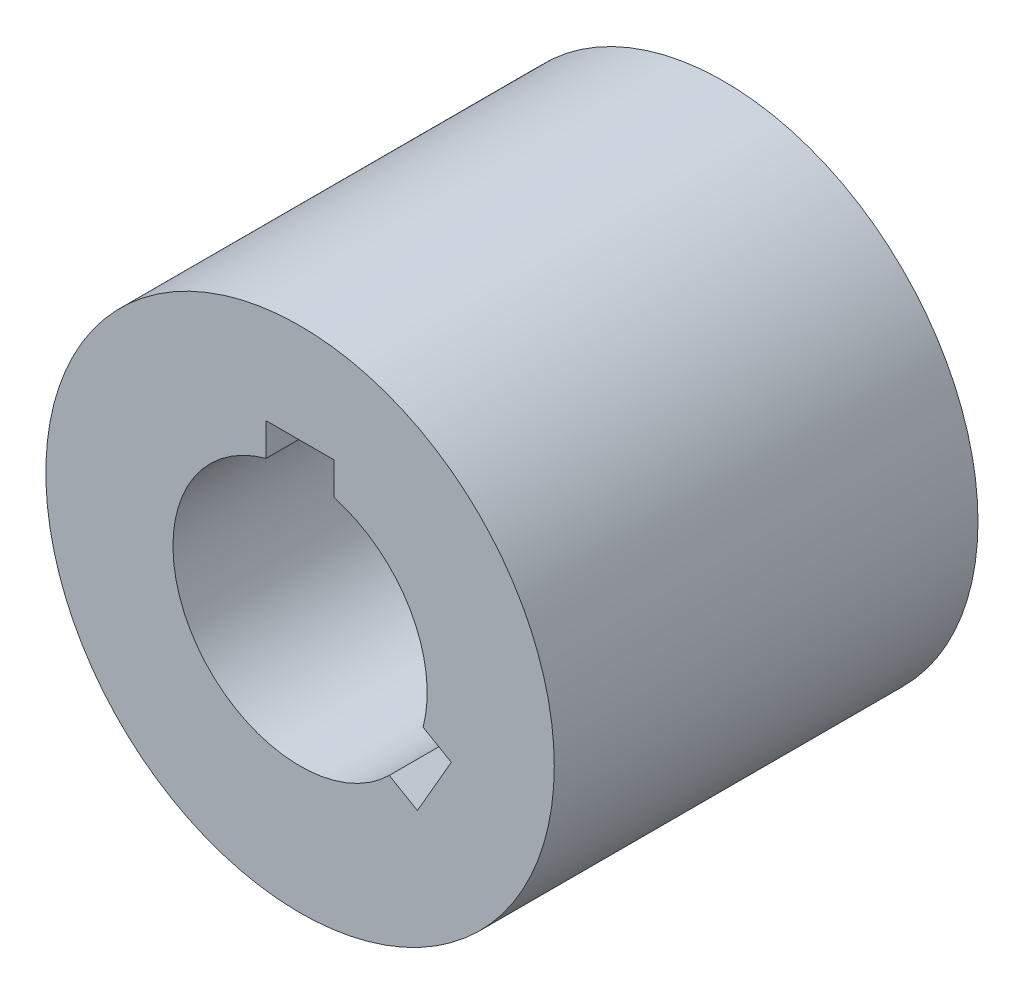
ISO-10303-21;
HEADER;
FILE_DESCRIPTION(('STEP AP214'),'2;1');
FILE_NAME('part.step','',(''),(''),'','','');
FILE_SCHEMA(('AUTOMOTIVE_DESIGN { 1 0 10303 214 1 1 1 1 }'));
ENDSEC;
DATA;
#1=APPLICATION_CONTEXT('core data for automotive mechanical design processes');
#2=APPLICATION_PROTOCOL_DEFINITION('international standard','automotive_design',2000,#1);
#3=PRODUCT_CONTEXT('',#1,'mechanical');
#4=PRODUCT('Part','Part','',(#3));
#5=PRODUCT_RELATED_PRODUCT_CATEGORY('part','',(#4));
#6=PRODUCT_DEFINITION_FORMATION('','',#4);
#7=PRODUCT_DEFINITION_CONTEXT('part definition',#1,'design');
#8=PRODUCT_DEFINITION('design','',#6,#7);
#9=PRODUCT_DEFINITION_SHAPE('','',#8);
#10=(LENGTH_UNIT() NAMED_UNIT(*) SI_UNIT(.MILLI.,.METRE.));
#11=(NAMED_UNIT(*) PLANE_ANGLE_UNIT() SI_UNIT($,.RADIAN.));
#12=(NAMED_UNIT(*) SI_UNIT($,.STERADIAN.) SOLID_ANGLE_UNIT());
#13=UNCERTAINTY_MEASURE_WITH_UNIT(LENGTH_MEASURE(1.E-05),#10,'distance_accuracy_value','');
#14=(GEOMETRIC_REPRESENTATION_CONTEXT(3) GLOBAL_UNCERTAINTY_ASSIGNED_CONTEXT((#13)) GLOBAL_UNIT_ASSIGNED_CONTEXT((#10,
#11,#12)) REPRESENTATION_CONTEXT('',''));
#15=CARTESIAN_POINT('',(0.,0.,0.));
#16=DIRECTION('',(0.,0.,1.));
#17=DIRECTION('',(1.,0.,0.));
#18=AXIS2_PLACEMENT_3D('',#15,#16,#17);
#19=CARTESIAN_POINT('',(0.,0.,50.));
#20=DIRECTION('',(0.,0.,1.));
#21=DIRECTION('',(1.,0.,0.));
#22=AXIS2_PLACEMENT_3D('',#19,#20,#21);
#23=PLANE('',#22);
#24=CARTESIAN_POINT('',(0.,0.,50.));
#25=DIRECTION('',(0.,0.,1.));
#26=DIRECTION('',(1.,0.,0.));
#27=AXIS2_PLACEMENT_3D('',#24,#25,#26);
#28=CIRCLE('',#27,30.);
#29=CARTESIAN_POINT('',(30.,0.,50.));
#30=VERTEX_POINT('',#29);
#31=EDGE_CURVE('E11',#30,#30,#28,.T.);
#32=ORIENTED_EDGE('',*,*,#31,.T.);
#33=EDGE_LOOP('',(#32));
#34=FACE_BOUND('',#33,.T.);
#35=DIRECTION('',(-0.866025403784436,0.500000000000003,0.));
#36=VECTOR('',#35,1.);
#37=CARTESIAN_POINT('',(17.8482648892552,-5.68589838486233,50.));
#38=LINE('',#37,#36);
#39=CARTESIAN_POINT('',(17.8482648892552,-5.68589838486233,50.));
#40=VERTEX_POINT('',#39);
#41=CARTESIAN_POINT('',(14.5199840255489,-3.76431453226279,50.));
#42=VERTEX_POINT('',#41);
#43=EDGE_CURVE('E142',#40,#42,#38,.T.);
#44=ORIENTED_EDGE('',*,*,#43,.F.);
#45=DIRECTION('',(0.500000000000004,0.866025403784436,0.));
#46=VECTOR('',#45,1.);
#47=CARTESIAN_POINT('',(17.8482648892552,-5.68589838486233,50.));
#48=LINE('',#47,#46);
#49=CARTESIAN_POINT('',(13.8482648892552,-12.6141016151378,50.));
#50=VERTEX_POINT('',#49);
#51=EDGE_CURVE('E115',#50,#40,#48,.T.);
#52=ORIENTED_EDGE('',*,*,#51,.F.);
#53=DIRECTION('',(0.866025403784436,-0.500000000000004,0.));
#54=VECTOR('',#53,1.);
#55=CARTESIAN_POINT('',(13.8482648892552,-12.6141016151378,50.));
#56=LINE('',#55,#54);
#57=CARTESIAN_POINT('',(10.5199840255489,-10.6925177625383,50.));
#58=VERTEX_POINT('',#57);
#59=EDGE_CURVE('E154',#58,#50,#56,.T.);
#60=ORIENTED_EDGE('',*,*,#59,.F.);
#61=CARTESIAN_POINT('',(0.,0.,50.));
#62=DIRECTION('',(0.,0.,1.));
#63=DIRECTION('',(1.,0.,0.));
#64=AXIS2_PLACEMENT_3D('',#61,#62,#63);
#65=CIRCLE('',#64,15.);
#66=CARTESIAN_POINT('',(-4.,14.456832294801,50.));
#67=VERTEX_POINT('',#66);
#68=EDGE_CURVE('E152',#67,#58,#65,.T.);
#69=ORIENTED_EDGE('',*,*,#68,.F.);
#70=DIRECTION('',(0.,-1.,0.));
#71=VECTOR('',#70,1.);
#72=CARTESIAN_POINT('',(-4.,18.3,50.));
#73=LINE('',#72,#71);
#74=CARTESIAN_POINT('',(-4.,18.3,50.));
#75=VERTEX_POINT('',#74);
#76=EDGE_CURVE('E150',#75,#67,#73,.T.);
#77=ORIENTED_EDGE('',*,*,#76,.F.);
#78=DIRECTION('',(-1.,0.,0.));
#79=VECTOR('',#78,1.);
#80=CARTESIAN_POINT('',(-4.,18.3,50.));
#81=LINE('',#80,#79);
#82=CARTESIAN_POINT('',(4.,18.3,50.));
#83=VERTEX_POINT('',#82);
#84=EDGE_CURVE('E148',#83,#75,#81,.T.);
#85=ORIENTED_EDGE('',*,*,#84,.F.);
#86=DIRECTION('',(0.,1.,0.));
#87=VECTOR('',#86,1.);
#88=CARTESIAN_POINT('',(4.,18.3,50.));
#89=LINE('',#88,#87);
#90=CARTESIAN_POINT('',(4.,14.456832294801,50.));
#91=VERTEX_POINT('',#90);
#92=EDGE_CURVE('E146',#91,#83,#89,.T.);
#93=ORIENTED_EDGE('',*,*,#92,.F.);
#94=CARTESIAN_POINT('',(0.,0.,50.));
#95=DIRECTION('',(0.,0.,1.));
#96=DIRECTION('',(1.,0.,0.));
#97=AXIS2_PLACEMENT_3D('',#94,#95,#96);
#98=CIRCLE('',#97,15.);
#99=EDGE_CURVE('E144',#42,#91,#98,.T.);
#100=ORIENTED_EDGE('',*,*,#99,.F.);
#101=EDGE_LOOP('',(#44,#52,#60,#69,#77,#85,#93,#100));
#102=FACE_BOUND('',#101,.T.);
#103=ADVANCED_FACE('F34',(#34,#102),#23,.T.);
#104=CARTESIAN_POINT('',(0.,0.,0.));
#105=DIRECTION('',(0.,0.,1.));
#106=DIRECTION('',(1.,0.,0.));
#107=AXIS2_PLACEMENT_3D('',#104,#105,#106);
#108=PLANE('',#107);
#109=CARTESIAN_POINT('',(0.,0.,0.));
#110=DIRECTION('',(0.,0.,1.));
#111=DIRECTION('',(1.,0.,0.));
#112=AXIS2_PLACEMENT_3D('',#109,#110,#111);
#113=CIRCLE('',#112,30.);
#114=CARTESIAN_POINT('',(30.,0.,0.));
#115=VERTEX_POINT('',#114);
#116=EDGE_CURVE('E43',#115,#115,#113,.T.);
#117=ORIENTED_EDGE('',*,*,#116,.F.);
#118=EDGE_LOOP('',(#117));
#119=FACE_BOUND('',#118,.T.);
#120=DIRECTION('',(0.500000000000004,0.866025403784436,0.));
#121=VECTOR('',#120,1.);
#122=CARTESIAN_POINT('',(17.8482648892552,-5.68589838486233,0.));
#123=LINE('',#122,#121);
#124=CARTESIAN_POINT('',(13.8482648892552,-12.6141016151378,0.));
#125=VERTEX_POINT('',#124);
#126=CARTESIAN_POINT('',(17.8482648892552,-5.68589838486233,0.));
#127=VERTEX_POINT('',#126);
#128=EDGE_CURVE('E58',#125,#127,#123,.T.);
#129=ORIENTED_EDGE('',*,*,#128,.T.);
#130=DIRECTION('',(-0.866025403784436,0.500000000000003,0.));
#131=VECTOR('',#130,1.);
#132=CARTESIAN_POINT('',(17.8482648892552,-5.68589838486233,0.));
#133=LINE('',#132,#131);
#134=CARTESIAN_POINT('',(14.5199840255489,-3.76431453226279,0.));
#135=VERTEX_POINT('',#134);
#136=EDGE_CURVE('E102',#127,#135,#133,.T.);
#137=ORIENTED_EDGE('',*,*,#136,.T.);
#138=CARTESIAN_POINT('',(0.,0.,0.));
#139=DIRECTION('',(0.,0.,1.));
#140=DIRECTION('',(1.,0.,0.));
#141=AXIS2_PLACEMENT_3D('',#138,#139,#140);
#142=CIRCLE('',#141,15.);
#143=CARTESIAN_POINT('',(4.,14.456832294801,0.));
#144=VERTEX_POINT('',#143);
#145=EDGE_CURVE('E111',#135,#144,#142,.T.);
#146=ORIENTED_EDGE('',*,*,#145,.T.);
#147=DIRECTION('',(0.,1.,0.));
#148=VECTOR('',#147,1.);
#149=CARTESIAN_POINT('',(4.,18.3,0.));
#150=LINE('',#149,#148);
#151=CARTESIAN_POINT('',(4.,18.3,0.));
#152=VERTEX_POINT('',#151);
#153=EDGE_CURVE('E127',#144,#152,#150,.T.);
#154=ORIENTED_EDGE('',*,*,#153,.T.);
#155=DIRECTION('',(-1.,0.,0.));
#156=VECTOR('',#155,1.);
#157=CARTESIAN_POINT('',(-4.,18.3,0.));
#158=LINE('',#157,#156);
#159=CARTESIAN_POINT('',(-4.,18.3,0.));
#160=VERTEX_POINT('',#159);
#161=EDGE_CURVE('E130',#152,#160,#158,.T.);
#162=ORIENTED_EDGE('',*,*,#161,.T.);
#163=DIRECTION('',(0.,-1.,0.));
#164=VECTOR('',#163,1.);
#165=CARTESIAN_POINT('',(-4.,18.3,0.));
#166=LINE('',#165,#164);
#167=CARTESIAN_POINT('',(-4.,14.456832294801,0.));
#168=VERTEX_POINT('',#167);
#169=EDGE_CURVE('E133',#160,#168,#166,.T.);
#170=ORIENTED_EDGE('',*,*,#169,.T.);
#171=CARTESIAN_POINT('',(0.,0.,0.));
#172=DIRECTION('',(0.,0.,1.));
#173=DIRECTION('',(1.,0.,0.));
#174=AXIS2_PLACEMENT_3D('',#171,#172,#173);
#175=CIRCLE('',#174,15.);
#176=CARTESIAN_POINT('',(10.5199840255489,-10.6925177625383,0.));
#177=VERTEX_POINT('',#176);
#178=EDGE_CURVE('E136',#168,#177,#175,.T.);
#179=ORIENTED_EDGE('',*,*,#178,.T.);
#180=DIRECTION('',(0.866025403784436,-0.500000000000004,0.));
#181=VECTOR('',#180,1.);
#182=CARTESIAN_POINT('',(13.8482648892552,-12.6141016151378,0.));
#183=LINE('',#182,#181);
#184=EDGE_CURVE('E120',#177,#125,#183,.T.);
#185=ORIENTED_EDGE('',*,*,#184,.T.);
#186=EDGE_LOOP('',(#129,#137,#146,#154,#162,#170,#179,#185));
#187=FACE_BOUND('',#186,.T.);
#188=ADVANCED_FACE('F118',(#119,#187),#108,.F.);
#189=CARTESIAN_POINT('',(0.,0.,50.));
#190=DIRECTION('',(0.,0.,-1.));
#191=DIRECTION('',(-1.,0.,0.));
#192=AXIS2_PLACEMENT_3D('',#189,#190,#191);
#193=CYLINDRICAL_SURFACE('',#192,30.);
#194=ORIENTED_EDGE('',*,*,#31,.F.);
#195=EDGE_LOOP('',(#194));
#196=FACE_BOUND('',#195,.T.);
#197=ORIENTED_EDGE('',*,*,#116,.T.);
#198=EDGE_LOOP('',(#197));
#199=FACE_BOUND('',#198,.T.);
#200=ADVANCED_FACE('F36',(#196,#199),#193,.T.);
#201=CARTESIAN_POINT('',(17.8482648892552,-5.68589838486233,50.));
#202=DIRECTION('',(-0.866025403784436,0.500000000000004,0.));
#203=DIRECTION('',(-0.500000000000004,-0.866025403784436,0.));
#204=AXIS2_PLACEMENT_3D('',#201,#202,#203);
#205=PLANE('',#204);
#206=ORIENTED_EDGE('',*,*,#128,.F.);
#207=DIRECTION('',(0.,0.,-1.));
#208=VECTOR('',#207,1.);
#209=CARTESIAN_POINT('',(13.8482648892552,-12.6141016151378,50.));
#210=LINE('',#209,#208);
#211=EDGE_CURVE('E156',#50,#125,#210,.T.);
#212=ORIENTED_EDGE('',*,*,#211,.F.);
#213=ORIENTED_EDGE('',*,*,#51,.T.);
#214=DIRECTION('',(0.,0.,-1.));
#215=VECTOR('',#214,1.);
#216=CARTESIAN_POINT('',(17.8482648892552,-5.68589838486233,50.));
#217=LINE('',#216,#215);
#218=EDGE_CURVE('E104',#40,#127,#217,.T.);
#219=ORIENTED_EDGE('',*,*,#218,.T.);
#220=EDGE_LOOP('',(#206,#212,#213,#219));
#221=FACE_BOUND('',#220,.T.);
#222=ADVANCED_FACE('F113',(#221),#205,.T.);
#223=CARTESIAN_POINT('',(17.8482648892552,-5.68589838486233,50.));
#224=DIRECTION('',(-0.500000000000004,-0.866025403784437,0.));
#225=DIRECTION('',(0.866025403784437,-0.500000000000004,0.));
#226=AXIS2_PLACEMENT_3D('',#223,#224,#225);
#227=PLANE('',#226);
#228=ORIENTED_EDGE('',*,*,#136,.F.);
#229=ORIENTED_EDGE('',*,*,#218,.F.);
#230=ORIENTED_EDGE('',*,*,#43,.T.);
#231=DIRECTION('',(0.,0.,-1.));
#232=VECTOR('',#231,1.);
#233=CARTESIAN_POINT('',(14.5199840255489,-3.76431453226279,50.));
#234=LINE('',#233,#232);
#235=EDGE_CURVE('E107',#42,#135,#234,.T.);
#236=ORIENTED_EDGE('',*,*,#235,.T.);
#237=EDGE_LOOP('',(#228,#229,#230,#236));
#238=FACE_BOUND('',#237,.T.);
#239=ADVANCED_FACE('F103',(#238),#227,.T.);
#240=CARTESIAN_POINT('',(0.,0.,50.));
#241=DIRECTION('',(0.,0.,-1.));
#242=DIRECTION('',(-1.,0.,0.));
#243=AXIS2_PLACEMENT_3D('',#240,#241,#242);
#244=CYLINDRICAL_SURFACE('',#243,15.);
#245=ORIENTED_EDGE('',*,*,#145,.F.);
#246=ORIENTED_EDGE('',*,*,#235,.F.);
#247=ORIENTED_EDGE('',*,*,#99,.T.);
#248=DIRECTION('',(0.,0.,-1.));
#249=VECTOR('',#248,1.);
#250=CARTESIAN_POINT('',(4.,14.456832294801,50.));
#251=LINE('',#250,#249);
#252=EDGE_CURVE('E165',#91,#144,#251,.T.);
#253=ORIENTED_EDGE('',*,*,#252,.T.);
#254=EDGE_LOOP('',(#245,#246,#247,#253));
#255=FACE_BOUND('',#254,.T.);
#256=ADVANCED_FACE('F183',(#255),#244,.F.);
#257=CARTESIAN_POINT('',(4.,18.3,50.));
#258=DIRECTION('',(-1.,0.,0.));
#259=DIRECTION('',(0.,-1.,0.));
#260=AXIS2_PLACEMENT_3D('',#257,#258,#259);
#261=PLANE('',#260);
#262=ORIENTED_EDGE('',*,*,#153,.F.);
#263=ORIENTED_EDGE('',*,*,#252,.F.);
#264=ORIENTED_EDGE('',*,*,#92,.T.);
#265=DIRECTION('',(0.,0.,-1.));
#266=VECTOR('',#265,1.);
#267=CARTESIAN_POINT('',(4.,18.3,50.));
#268=LINE('',#267,#266);
#269=EDGE_CURVE('E163',#83,#152,#268,.T.);
#270=ORIENTED_EDGE('',*,*,#269,.T.);
#271=EDGE_LOOP('',(#262,#263,#264,#270));
#272=FACE_BOUND('',#271,.T.);
#273=ADVANCED_FACE('F186',(#272),#261,.T.);
#274=CARTESIAN_POINT('',(-4.,18.3,50.));
#275=DIRECTION('',(0.,-1.,0.));
#276=DIRECTION('',(0.,0.,-1.));
#277=AXIS2_PLACEMENT_3D('',#274,#275,#276);
#278=PLANE('',#277);
#279=ORIENTED_EDGE('',*,*,#161,.F.);
#280=ORIENTED_EDGE('',*,*,#269,.F.);
#281=ORIENTED_EDGE('',*,*,#84,.T.);
#282=DIRECTION('',(0.,0.,-1.));
#283=VECTOR('',#282,1.);
#284=CARTESIAN_POINT('',(-4.,18.3,50.));
#285=LINE('',#284,#283);
#286=EDGE_CURVE('E161',#75,#160,#285,.T.);
#287=ORIENTED_EDGE('',*,*,#286,.T.);
#288=EDGE_LOOP('',(#279,#280,#281,#287));
#289=FACE_BOUND('',#288,.T.);
#290=ADVANCED_FACE('F190',(#289),#278,.T.);
#291=CARTESIAN_POINT('',(-4.,18.3,50.));
#292=DIRECTION('',(1.,0.,0.));
#293=DIRECTION('',(0.,1.,0.));
#294=AXIS2_PLACEMENT_3D('',#291,#292,#293);
#295=PLANE('',#294);
#296=ORIENTED_EDGE('',*,*,#169,.F.);
#297=ORIENTED_EDGE('',*,*,#286,.F.);
#298=ORIENTED_EDGE('',*,*,#76,.T.);
#299=DIRECTION('',(0.,0.,-1.));
#300=VECTOR('',#299,1.);
#301=CARTESIAN_POINT('',(-4.,14.456832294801,50.));
#302=LINE('',#301,#300);
#303=EDGE_CURVE('E159',#67,#168,#302,.T.);
#304=ORIENTED_EDGE('',*,*,#303,.T.);
#305=EDGE_LOOP('',(#296,#297,#298,#304));
#306=FACE_BOUND('',#305,.T.);
#307=ADVANCED_FACE('F194',(#306),#295,.T.);
#308=CARTESIAN_POINT('',(0.,0.,50.));
#309=DIRECTION('',(0.,0.,-1.));
#310=DIRECTION('',(-1.,0.,0.));
#311=AXIS2_PLACEMENT_3D('',#308,#309,#310);
#312=CYLINDRICAL_SURFACE('',#311,15.);
#313=ORIENTED_EDGE('',*,*,#178,.F.);
#314=ORIENTED_EDGE('',*,*,#303,.F.);
#315=ORIENTED_EDGE('',*,*,#68,.T.);
#316=DIRECTION('',(0.,0.,-1.));
#317=VECTOR('',#316,1.);
#318=CARTESIAN_POINT('',(10.5199840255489,-10.6925177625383,50.));
#319=LINE('',#318,#317);
#320=EDGE_CURVE('E50',#58,#177,#319,.T.);
#321=ORIENTED_EDGE('',*,*,#320,.T.);
#322=EDGE_LOOP('',(#313,#314,#315,#321));
#323=FACE_BOUND('',#322,.T.);
#324=ADVANCED_FACE('F198',(#323),#312,.F.);
#325=CARTESIAN_POINT('',(13.8482648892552,-12.6141016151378,50.));
#326=DIRECTION('',(0.500000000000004,0.866025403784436,0.));
#327=DIRECTION('',(-0.866025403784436,0.500000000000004,0.));
#328=AXIS2_PLACEMENT_3D('',#325,#326,#327);
#329=PLANE('',#328);
#330=ORIENTED_EDGE('',*,*,#184,.F.);
#331=ORIENTED_EDGE('',*,*,#320,.F.);
#332=ORIENTED_EDGE('',*,*,#59,.T.);
#333=ORIENTED_EDGE('',*,*,#211,.T.);
#334=EDGE_LOOP('',(#330,#331,#332,#333));
#335=FACE_BOUND('',#334,.T.);
#336=ADVANCED_FACE('F202',(#335),#329,.T.);
#337=CLOSED_SHELL('',(#103,#188,#200,#222,#239,#256,#273,#290,#307,#324,#336));
#338=MANIFOLD_SOLID_BREP('B2',#337);
#339=ADVANCED_BREP_SHAPE_REPRESENTATION('',(#18,#338),#14);
#340=SHAPE_DEFINITION_REPRESENTATION(#9,#339);
ENDSEC;
END-ISO-10303-21;
